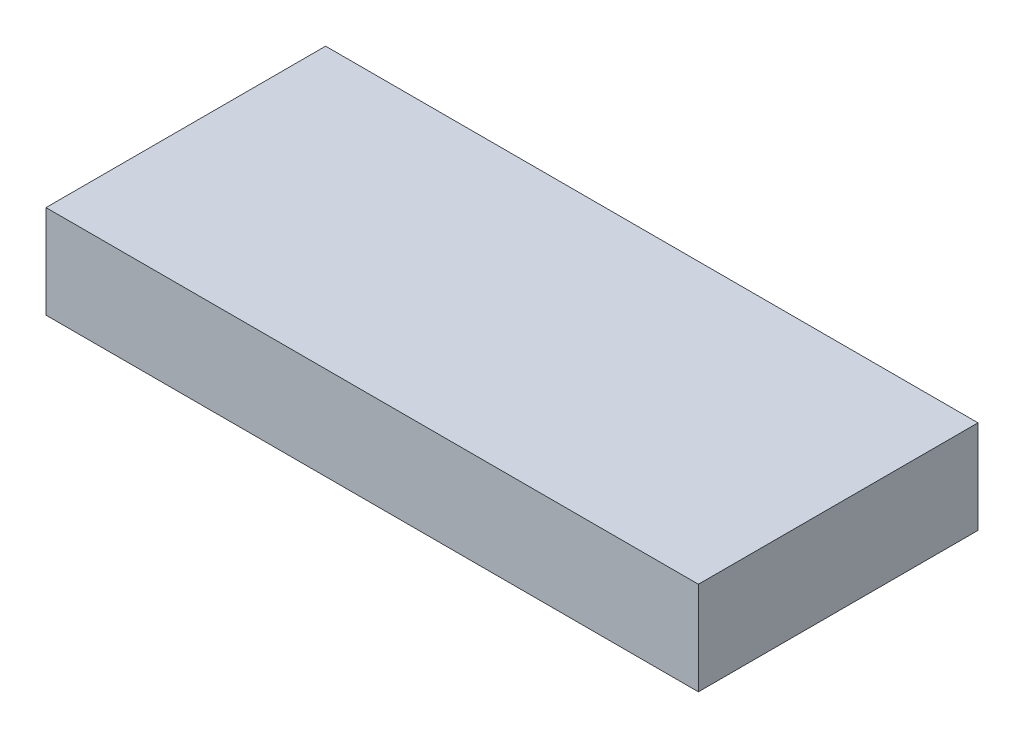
from build123d import *

# Parameters (mm, degrees)
ESQUISSE1_W        = 700
ESQUISSE1_H        = 100
BOSS_EXTRU_1_DEPTH = 150


with BuildPart() as part:
    # Esquisse1 → Boss.-Extru.1 (new, symmetric)
    with BuildSketch(Plane.XY):
        Rectangle(ESQUISSE1_W, ESQUISSE1_H)
    extrude(amount=BOSS_EXTRU_1_DEPTH, both=True)


solid = part.part
